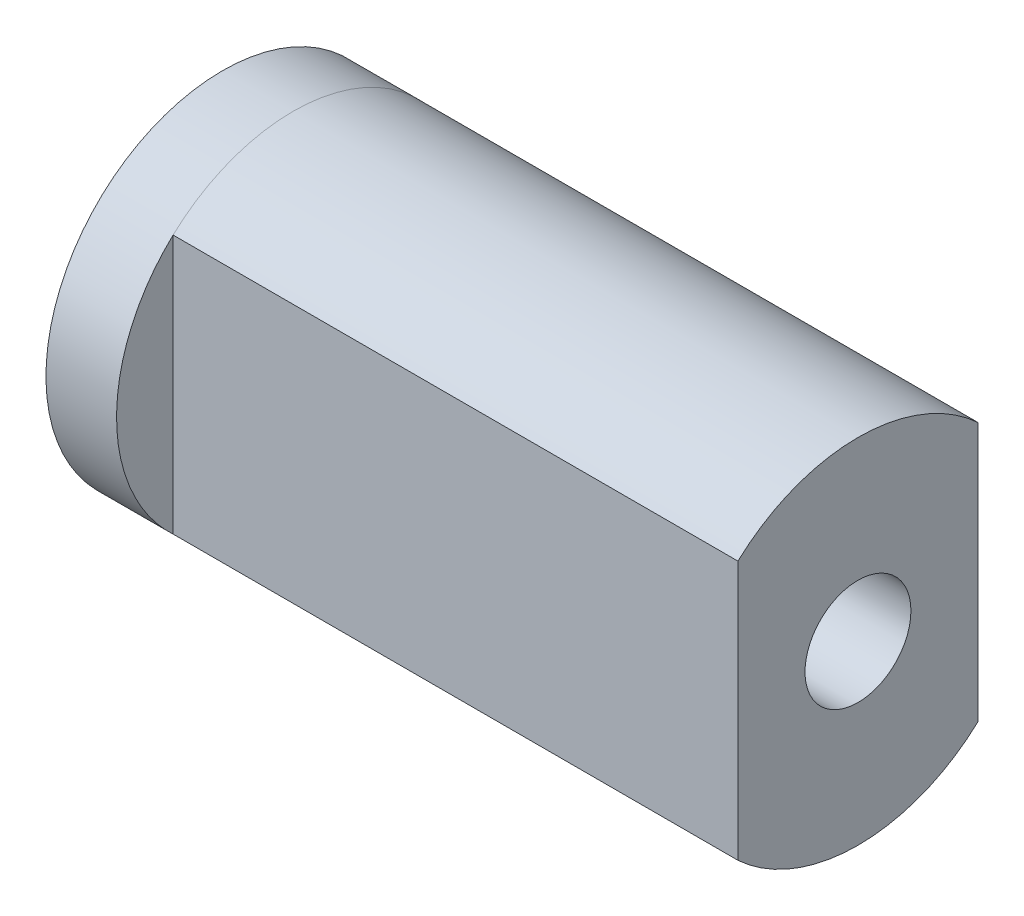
ISO-10303-21;
HEADER;
FILE_DESCRIPTION(('STEP AP214'),'2;1');
FILE_NAME('part.step','',(''),(''),'','','');
FILE_SCHEMA(('AUTOMOTIVE_DESIGN { 1 0 10303 214 1 1 1 1 }'));
ENDSEC;
DATA;
#1=APPLICATION_CONTEXT('core data for automotive mechanical design processes');
#2=APPLICATION_PROTOCOL_DEFINITION('international standard','automotive_design',2000,#1);
#3=PRODUCT_CONTEXT('',#1,'mechanical');
#4=PRODUCT('Part','Part','',(#3));
#5=PRODUCT_RELATED_PRODUCT_CATEGORY('part','',(#4));
#6=PRODUCT_DEFINITION_FORMATION('','',#4);
#7=PRODUCT_DEFINITION_CONTEXT('part definition',#1,'design');
#8=PRODUCT_DEFINITION('design','',#6,#7);
#9=PRODUCT_DEFINITION_SHAPE('','',#8);
#10=(LENGTH_UNIT() NAMED_UNIT(*) SI_UNIT(.MILLI.,.METRE.));
#11=(NAMED_UNIT(*) PLANE_ANGLE_UNIT() SI_UNIT($,.RADIAN.));
#12=(NAMED_UNIT(*) SI_UNIT($,.STERADIAN.) SOLID_ANGLE_UNIT());
#13=UNCERTAINTY_MEASURE_WITH_UNIT(LENGTH_MEASURE(1.E-05),#10,'distance_accuracy_value','');
#14=(GEOMETRIC_REPRESENTATION_CONTEXT(3) GLOBAL_UNCERTAINTY_ASSIGNED_CONTEXT((#13)) GLOBAL_UNIT_ASSIGNED_CONTEXT((#10,
#11,#12)) REPRESENTATION_CONTEXT('',''));
#15=CARTESIAN_POINT('',(0.,0.,0.));
#16=DIRECTION('',(0.,0.,1.));
#17=DIRECTION('',(1.,0.,0.));
#18=AXIS2_PLACEMENT_3D('',#15,#16,#17);
#19=CARTESIAN_POINT('',(1.,0.,0.));
#20=DIRECTION('',(1.,0.,0.));
#21=DIRECTION('',(0.,0.,-1.));
#22=AXIS2_PLACEMENT_3D('',#19,#20,#21);
#23=PLANE('',#22);
#24=DIRECTION('',(0.,-1.,0.));
#25=VECTOR('',#24,1.);
#26=CARTESIAN_POINT('',(1.,1.835,1.7));
#27=LINE('',#26,#25);
#28=CARTESIAN_POINT('',(1.,1.833936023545,1.69964922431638));
#29=VERTEX_POINT('',#28);
#30=CARTESIAN_POINT('',(1.,-1.83395021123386,1.69964698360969));
#31=VERTEX_POINT('',#30);
#32=EDGE_CURVE('E98',#29,#31,#27,.T.);
#33=ORIENTED_EDGE('',*,*,#32,.F.);
#34=CARTESIAN_POINT('',(1.,1.83352277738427,1.69952071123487));
#35=CARTESIAN_POINT('',(1.,1.81201965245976,1.72266553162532));
#36=CARTESIAN_POINT('',(1.,1.79009831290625,1.74542135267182));
#37=CARTESIAN_POINT('',(1.,1.74929792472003,1.78624775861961));
#38=CARTESIAN_POINT('',(1.,1.73054844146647,1.80444797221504));
#39=CARTESIAN_POINT('',(1.,1.69064109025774,1.84201087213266));
#40=CARTESIAN_POINT('',(1.,1.66942675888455,1.86131366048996));
#41=CARTESIAN_POINT('',(1.,1.62644035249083,1.89909971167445));
#42=CARTESIAN_POINT('',(1.,1.60467103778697,1.91758611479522));
#43=CARTESIAN_POINT('',(1.,1.56057551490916,1.95374038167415));
#44=CARTESIAN_POINT('',(1.,1.53825124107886,1.97141060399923));
#45=CARTESIAN_POINT('',(1.,1.49304663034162,2.00593324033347));
#46=CARTESIAN_POINT('',(1.,1.47016743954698,2.02278715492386));
#47=CARTESIAN_POINT('',(1.,1.42385378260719,2.05567807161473));
#48=CARTESIAN_POINT('',(1.,1.40041972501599,2.07171564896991));
#49=CARTESIAN_POINT('',(1.,1.3529970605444,2.10297482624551));
#50=CARTESIAN_POINT('',(1.,1.32900818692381,2.11819602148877));
#51=CARTESIAN_POINT('',(1.,1.28047657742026,2.14782342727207));
#52=CARTESIAN_POINT('',(1.,1.25593297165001,2.16222821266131));
#53=CARTESIAN_POINT('',(1.,1.20629240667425,2.19022382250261));
#54=CARTESIAN_POINT('',(1.,1.18119405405,2.20381217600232));
#55=CARTESIAN_POINT('',(1.,1.13044480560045,2.23017597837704));
#56=CARTESIAN_POINT('',(1.,1.10479207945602,2.24294790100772));
#57=CARTESIAN_POINT('',(1.,1.05293336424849,2.26767985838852));
#58=CARTESIAN_POINT('',(1.,1.02672518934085,2.27963531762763));
#59=CARTESIAN_POINT('',(1.,0.985843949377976,2.2974652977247));
#60=CARTESIAN_POINT('',(1.,0.971304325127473,2.30364862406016));
#61=CARTESIAN_POINT('',(1.,0.918052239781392,2.32572260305));
#62=CARTESIAN_POINT('',(1.,0.879002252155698,2.34081262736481));
#63=CARTESIAN_POINT('',(1.,0.8126715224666,2.36456467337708));
#64=CARTESIAN_POINT('',(1.,0.785576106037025,2.37374990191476));
#65=CARTESIAN_POINT('',(1.,0.731183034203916,2.39115111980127));
#66=CARTESIAN_POINT('',(1.,0.703886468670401,2.39937050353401));
#67=CARTESIAN_POINT('',(1.,0.649092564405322,2.41484028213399));
#68=CARTESIAN_POINT('',(1.,0.621595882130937,2.42209300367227));
#69=CARTESIAN_POINT('',(1.,0.56640190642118,2.43563075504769));
#70=CARTESIAN_POINT('',(1.,0.538704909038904,2.44191699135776));
#71=CARTESIAN_POINT('',(1.,0.483110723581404,2.45352284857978));
#72=CARTESIAN_POINT('',(1.,0.455213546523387,2.45884252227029));
#73=CARTESIAN_POINT('',(1.,0.399219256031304,2.46851643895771));
#74=CARTESIAN_POINT('',(1.,0.371121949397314,2.47286956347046));
#75=CARTESIAN_POINT('',(1.,0.314727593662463,2.48061152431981));
#76=CARTESIAN_POINT('',(1.,0.286430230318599,2.48399807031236));
#77=CARTESIAN_POINT('',(1.,0.229635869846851,2.48980814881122));
#78=CARTESIAN_POINT('',(1.,0.201138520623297,2.49222823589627));
#79=CARTESIAN_POINT('',(1.,0.143967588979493,2.49610456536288));
#80=CARTESIAN_POINT('',(1.,0.115293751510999,2.49755703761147));
#81=CARTESIAN_POINT('',(1.,0.0577467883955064,2.49950386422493));
#82=CARTESIAN_POINT('',(1.,0.0288734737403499,2.49999259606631));
#83=CARTESIAN_POINT('',(1.,-0.028840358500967,2.50000739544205));
#84=CARTESIAN_POINT('',(1.,-0.0576808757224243,2.49953456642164));
#85=CARTESIAN_POINT('',(1.,-0.115176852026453,2.49761145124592));
#86=CARTESIAN_POINT('',(1.,-0.143832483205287,2.49616634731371));
#87=CARTESIAN_POINT('',(1.,-0.200935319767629,2.49230279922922));
#88=CARTESIAN_POINT('',(1.,-0.229382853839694,2.48988922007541));
#89=CARTESIAN_POINT('',(1.,-0.286092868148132,2.4840894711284));
#90=CARTESIAN_POINT('',(1.,-0.314355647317,2.48070622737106));
#91=CARTESIAN_POINT('',(1.,-0.370696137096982,2.4729684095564));
#92=CARTESIAN_POINT('',(1.,-0.398774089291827,2.46861559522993));
#93=CARTESIAN_POINT('',(1.,-0.45474499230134,2.45893978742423));
#94=CARTESIAN_POINT('',(1.,-0.482638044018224,2.45361737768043));
#95=CARTESIAN_POINT('',(1.,-0.538239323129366,2.4420035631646));
#96=CARTESIAN_POINT('',(1.,-0.565947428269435,2.43571157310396));
#97=CARTESIAN_POINT('',(1.,-0.621178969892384,2.42215978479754));
#98=CARTESIAN_POINT('',(1.,-0.648701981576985,2.41489825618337));
#99=CARTESIAN_POINT('',(1.,-0.703563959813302,2.3994084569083));
#100=CARTESIAN_POINT('',(1.,-0.730902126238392,2.3911773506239));
#101=CARTESIAN_POINT('',(1.,-0.785393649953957,2.3737497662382));
#102=CARTESIAN_POINT('',(1.,-0.812545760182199,2.36454940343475));
#103=CARTESIAN_POINT('',(1.,-0.878954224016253,2.34078788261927));
#104=CARTESIAN_POINT('',(1.,-0.918027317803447,2.32570896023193));
#105=CARTESIAN_POINT('',(1.,-0.971352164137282,2.30363786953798));
#106=CARTESIAN_POINT('',(1.,-0.985939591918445,2.29744345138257));
#107=CARTESIAN_POINT('',(1.,-1.02680611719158,2.2796397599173));
#108=CARTESIAN_POINT('',(1.,-1.05295176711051,2.26772134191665));
#109=CARTESIAN_POINT('',(1.,-1.10469880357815,2.24305586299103));
#110=CARTESIAN_POINT('',(1.,-1.13030216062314,2.23031292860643));
#111=CARTESIAN_POINT('',(1.,-1.18096574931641,2.20399876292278));
#112=CARTESIAN_POINT('',(1.,-1.2060275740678,2.19043060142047));
#113=CARTESIAN_POINT('',(1.,-1.25560826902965,2.16246724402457));
#114=CARTESIAN_POINT('',(1.,-1.28012827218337,2.14807405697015));
#115=CARTESIAN_POINT('',(1.,-1.3286258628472,2.11846166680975));
#116=CARTESIAN_POINT('',(1.,-1.35260403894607,2.10324342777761));
#117=CARTESIAN_POINT('',(1.,-1.40001851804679,2.07198199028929));
#118=CARTESIAN_POINT('',(1.,-1.42345478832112,2.05593874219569));
#119=CARTESIAN_POINT('',(1.,-1.46978610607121,2.02302830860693));
#120=CARTESIAN_POINT('',(1.,-1.49268043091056,2.00616010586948));
#121=CARTESIAN_POINT('',(1.,-1.53792852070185,1.97160066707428));
#122=CARTESIAN_POINT('',(1.,-1.56028081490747,1.95390750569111));
#123=CARTESIAN_POINT('',(1.,-1.60444574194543,1.91769925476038));
#124=CARTESIAN_POINT('',(1.,-1.62625611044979,1.89918140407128));
#125=CARTESIAN_POINT('',(1.,-1.66933745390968,1.86132380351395));
#126=CARTESIAN_POINT('',(1.,-1.69060533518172,1.84198053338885));
#127=CARTESIAN_POINT('',(1.,-1.73055920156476,1.80439964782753));
#128=CARTESIAN_POINT('',(1.,-1.74930302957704,1.78622344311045));
#129=CARTESIAN_POINT('',(1.,-1.79011471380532,1.74542818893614));
#130=CARTESIAN_POINT('',(1.,-1.8120524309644,1.72267882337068));
#131=CARTESIAN_POINT('',(1.,-1.83356698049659,1.6995348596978));
#132=B_SPLINE_CURVE_WITH_KNOTS('',3,(#34,#35,#36,#37,#38,#39,#40,#41,#42,#43,#44,#45,#46,#47,
#48,#49,#50,#51,#52,#53,#54,#55,#56,#57,#58,#59,#60,#61,#62,#63,#64,#65,#66,#67,#68,#69,#70,#71,
#72,#73,#74,#75,#76,#77,#78,#79,#80,#81,#82,#83,#84,#85,#86,#87,#88,#89,#90,#91,#92,#93,#94,#95,
#96,#97,#98,#99,#100,#101,#102,#103,#104,#105,#106,#107,#108,#109,#110,#111,#112,#113,#114,#115,
#116,#117,#118,#119,#120,#121,#122,#123,#124,#125,#126,#127,#128,#129,#130,#131),.UNSPECIFIED.,
.F.,.F.,(4,2,2,2,2,2,2,2,2,2,2,2,2,2,2,2,2,2,2,2,2,2,2,2,2,2,2,2,2,2,2,2,2,2,2,2,2,2,2,2,2,2,2,
2,2,2,2,2,4),(0.,0.0947701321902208,0.173149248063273,0.259177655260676,0.344839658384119,
0.430236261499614,0.515469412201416,0.600641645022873,0.685855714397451,0.771214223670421,
0.856819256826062,0.942772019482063,1.02917249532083,1.0765706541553,1.20210309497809,
1.28791841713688,1.37342250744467,1.45871692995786,1.54390399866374,1.62908641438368,
1.71436689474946,1.79984780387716,1.88563078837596,1.97174608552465,2.05836231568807,
2.1448792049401,2.23093857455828,2.31657094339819,2.40194758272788,2.48717051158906,
2.57234230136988,2.65756570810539,2.74294330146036,2.82857709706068,2.91456819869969,
3.04015407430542,3.08769717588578,3.17388070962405,3.25966205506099,3.34514179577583,
3.43042158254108,3.5156037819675,3.60079111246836,3.68608627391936,3.77159157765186,
3.85740858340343,3.94363774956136,4.02195462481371,4.11674524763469),.UNSPECIFIED.);
#133=EDGE_CURVE('E44',#29,#31,#132,.T.);
#134=ORIENTED_EDGE('',*,*,#133,.T.);
#135=EDGE_LOOP('',(#33,#134));
#136=FACE_BOUND('',#135,.T.);
#137=ADVANCED_FACE('F33',(#136),#23,.T.);
#138=CARTESIAN_POINT('',(1.,0.,0.));
#139=DIRECTION('',(-1.,0.,0.));
#140=DIRECTION('',(0.,0.,1.));
#141=AXIS2_PLACEMENT_3D('',#138,#139,#140);
#142=CYLINDRICAL_SURFACE('',#141,2.5);
#143=CARTESIAN_POINT('',(1.,0.,0.));
#144=DIRECTION('',(1.,0.,0.));
#145=DIRECTION('',(0.,0.733576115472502,-0.679607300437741));
#146=AXIS2_PLACEMENT_3D('',#143,#144,#145);
#147=CIRCLE('',#146,2.5014445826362);
#148=CARTESIAN_POINT('',(1.,1.83395021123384,-1.6996469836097));
#149=VERTEX_POINT('',#148);
#150=EDGE_CURVE('E11',#149,#29,#147,.T.);
#151=ORIENTED_EDGE('',*,*,#150,.F.);
#152=CARTESIAN_POINT('',(1.,-1.83352266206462,-1.69952083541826));
#153=CARTESIAN_POINT('',(1.,-1.8120195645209,-1.72266616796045));
#154=CARTESIAN_POINT('',(1.,-1.79009812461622,-1.74542177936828));
#155=CARTESIAN_POINT('',(1.,-1.75444729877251,-1.7810949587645));
#156=CARTESIAN_POINT('',(1.,-1.74098187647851,-1.79427694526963));
#157=CARTESIAN_POINT('',(1.,-1.71381360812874,-1.82029177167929));
#158=CARTESIAN_POINT('',(1.,-1.70011182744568,-1.83312572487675));
#159=CARTESIAN_POINT('',(1.,-1.66094992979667,-1.86899698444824));
#160=CARTESIAN_POINT('',(1.,-1.6351577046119,-1.89167373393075));
#161=CARTESIAN_POINT('',(1.,-1.58277051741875,-1.9358462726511));
#162=CARTESIAN_POINT('',(1.,-1.55617946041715,-1.95734669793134));
#163=CARTESIAN_POINT('',(1.,-1.50219547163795,-1.99916901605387));
#164=CARTESIAN_POINT('',(1.,-1.4748047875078,-2.01949380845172));
#165=CARTESIAN_POINT('',(1.,-1.41922347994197,-2.05896641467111));
#166=CARTESIAN_POINT('',(1.,-1.3910335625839,-2.07811522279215));
#167=CARTESIAN_POINT('',(1.,-1.33385510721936,-2.11523788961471));
#168=CARTESIAN_POINT('',(1.,-1.30486588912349,-2.13321070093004));
#169=CARTESIAN_POINT('',(1.,-1.24609075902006,-2.1679833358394));
#170=CARTESIAN_POINT('',(1.,-1.21630296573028,-2.18477997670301));
#171=CARTESIAN_POINT('',(1.,-1.14902578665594,-2.22091048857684));
#172=CARTESIAN_POINT('',(1.,-1.11136229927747,-2.23992090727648));
#173=CARTESIAN_POINT('',(1.,-1.03483887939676,-2.27618479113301));
#174=CARTESIAN_POINT('',(1.,-0.995971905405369,-2.29342339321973));
#175=CARTESIAN_POINT('',(1.,-0.932007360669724,-2.31993798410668));
#176=CARTESIAN_POINT('',(1.,-0.907149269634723,-2.32979592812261));
#177=CARTESIAN_POINT('',(1.,-0.857261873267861,-2.34867542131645));
#178=CARTESIAN_POINT('',(1.,-0.832234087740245,-2.35770097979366));
#179=CARTESIAN_POINT('',(1.,-0.774644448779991,-2.37744132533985));
#180=CARTESIAN_POINT('',(1.,-0.741991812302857,-2.38789240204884));
#181=CARTESIAN_POINT('',(1.,-0.67640197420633,-2.40739491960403));
#182=CARTESIAN_POINT('',(1.,-0.643466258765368,-2.41645136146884));
#183=CARTESIAN_POINT('',(1.,-0.577310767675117,-2.43316714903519));
#184=CARTESIAN_POINT('',(1.,-0.544091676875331,-2.44082920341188));
#185=CARTESIAN_POINT('',(1.,-0.477370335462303,-2.45475846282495));
#186=CARTESIAN_POINT('',(1.,-0.443868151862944,-2.4610259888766));
#187=CARTESIAN_POINT('',(1.,-0.376581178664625,-2.4721686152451));
#188=CARTESIAN_POINT('',(1.,-0.342796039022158,-2.47704160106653));
#189=CARTESIAN_POINT('',(1.,-0.274943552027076,-2.48539763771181));
#190=CARTESIAN_POINT('',(1.,-0.240875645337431,-2.48887614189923));
#191=CARTESIAN_POINT('',(1.,-0.172481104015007,-2.49444354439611));
#192=CARTESIAN_POINT('',(1.,-0.138153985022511,-2.49652647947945));
#193=CARTESIAN_POINT('',(1.,-0.069218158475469,-2.49930961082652));
#194=CARTESIAN_POINT('',(1.,-0.0346090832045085,-2.50000062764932));
#195=CARTESIAN_POINT('',(1.,0.0346071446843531,-2.49999937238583));
#196=CARTESIAN_POINT('',(1.,0.0692142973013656,-2.49930717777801));
#197=CARTESIAN_POINT('',(1.,0.138156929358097,-2.49651714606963));
#198=CARTESIAN_POINT('',(1.,0.172492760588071,-2.49442807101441));
#199=CARTESIAN_POINT('',(1.,0.240869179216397,-2.48884912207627));
#200=CARTESIAN_POINT('',(1.,0.274910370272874,-2.48536665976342));
#201=CARTESIAN_POINT('',(1.,0.342720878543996,-2.47700310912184));
#202=CARTESIAN_POINT('',(1.,0.376490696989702,-2.47212608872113));
#203=CARTESIAN_POINT('',(1.,0.443758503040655,-2.46097588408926));
#204=CARTESIAN_POINT('',(1.,0.477256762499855,-2.4547043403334));
#205=CARTESIAN_POINT('',(1.,0.543981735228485,-2.44076756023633));
#206=CARTESIAN_POINT('',(1.,0.577208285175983,-2.43310154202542));
#207=CARTESIAN_POINT('',(1.,0.643390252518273,-2.41637810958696));
#208=CARTESIAN_POINT('',(1.,0.676344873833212,-2.40731754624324));
#209=CARTESIAN_POINT('',(1.,0.741983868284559,-2.38780787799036));
#210=CARTESIAN_POINT('',(1.,0.774666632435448,-2.37735336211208));
#211=CARTESIAN_POINT('',(1.,0.839761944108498,-2.35505613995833));
#212=CARTESIAN_POINT('',(1.,0.872171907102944,-2.34320589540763));
#213=CARTESIAN_POINT('',(1.,0.936639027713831,-2.31816003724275));
#214=CARTESIAN_POINT('',(1.,0.96869387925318,-2.30495849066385));
#215=CARTESIAN_POINT('',(1.,1.03205823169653,-2.27734979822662));
#216=CARTESIAN_POINT('',(1.,1.06337098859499,-2.26295013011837));
#217=CARTESIAN_POINT('',(1.,1.12521263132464,-2.23295426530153));
#218=CARTESIAN_POINT('',(1.,1.15574480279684,-2.21736484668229));
#219=CARTESIAN_POINT('',(1.,1.21602655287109,-2.18499318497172));
#220=CARTESIAN_POINT('',(1.,1.24577858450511,-2.16821551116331));
#221=CARTESIAN_POINT('',(1.,1.30450076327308,-2.13346916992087));
#222=CARTESIAN_POINT('',(1.,1.33347232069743,-2.1155028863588));
#223=CARTESIAN_POINT('',(1.,1.39063469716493,-2.07838164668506));
#224=CARTESIAN_POINT('',(1.,1.41882568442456,-2.0592269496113));
#225=CARTESIAN_POINT('',(1.,1.47442813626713,-2.01973091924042));
#226=CARTESIAN_POINT('',(1.,1.50183835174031,-1.99938782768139));
#227=CARTESIAN_POINT('',(1.,1.55588091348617,-1.95751722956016));
#228=CARTESIAN_POINT('',(1.,1.58251044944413,-1.93598609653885));
#229=CARTESIAN_POINT('',(1.,1.6349924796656,-1.89174044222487));
#230=CARTESIAN_POINT('',(1.,1.66084049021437,-1.86902060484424));
#231=CARTESIAN_POINT('',(1.,1.71176399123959,-1.82240221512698));
#232=CARTESIAN_POINT('',(1.,1.73683327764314,-1.79849688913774));
#233=CARTESIAN_POINT('',(1.,1.78595816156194,-1.74972802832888));
#234=CARTESIAN_POINT('',(1.,1.81001501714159,-1.72486576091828));
#235=CARTESIAN_POINT('',(1.,1.83356698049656,-1.69953485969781));
#236=B_SPLINE_CURVE_WITH_KNOTS('',3,(#152,#153,#154,#155,#156,#157,#158,#159,#160,#161,#162,
#163,#164,#165,#166,#167,#168,#169,#170,#171,#172,#173,#174,#175,#176,#177,#178,#179,#180,#181,
#182,#183,#184,#185,#186,#187,#188,#189,#190,#191,#192,#193,#194,#195,#196,#197,#198,#199,#200,
#201,#202,#203,#204,#205,#206,#207,#208,#209,#210,#211,#212,#213,#214,#215,#216,#217,#218,#219,
#220,#221,#222,#223,#224,#225,#226,#227,#228,#229,#230,#231,#232,#233,#234,#235),.UNSPECIFIED.,
.F.,.F.,(4,2,2,2,2,2,2,2,2,2,2,2,2,2,2,2,2,2,2,2,2,2,2,2,2,2,2,2,2,2,2,2,2,2,2,2,2,2,2,2,2,4),
(0.,0.0947699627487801,0.151296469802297,0.207613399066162,0.310612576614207,0.413171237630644,
0.515465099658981,0.617671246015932,0.719967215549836,0.822530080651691,0.949043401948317,
1.07654366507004,1.15675623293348,1.23655970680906,1.33938274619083,1.44182802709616,
1.54407212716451,1.64629266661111,1.74866738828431,1.85137323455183,1.95451518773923,
2.05833514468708,2.16214928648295,2.26531827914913,2.36794564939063,2.47027665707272,
2.57248791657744,2.67475666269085,2.77725983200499,2.88017315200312,2.98367026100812,
3.08764303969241,3.191009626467,3.2938259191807,3.39626631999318,3.49850715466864,
3.60072578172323,3.70309967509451,3.80580550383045,3.90901823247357,4.01291026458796,
4.11666913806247),.UNSPECIFIED.);
#237=CARTESIAN_POINT('',(1.,-1.83393587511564,-1.69964929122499));
#238=VERTEX_POINT('',#237);
#239=EDGE_CURVE('E105',#238,#149,#236,.T.);
#240=ORIENTED_EDGE('',*,*,#239,.F.);
#241=CARTESIAN_POINT('',(1.,0.,0.));
#242=DIRECTION('',(1.,0.,0.));
#243=DIRECTION('',(0.,-0.733576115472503,0.67960730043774));
#244=AXIS2_PLACEMENT_3D('',#241,#242,#243);
#245=CIRCLE('',#244,2.5014445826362);
#246=EDGE_CURVE('E56',#31,#238,#245,.T.);
#247=ORIENTED_EDGE('',*,*,#246,.F.);
#248=ORIENTED_EDGE('',*,*,#133,.F.);
#249=EDGE_LOOP('',(#151,#240,#247,#248));
#250=FACE_BOUND('',#249,.T.);
#251=CARTESIAN_POINT('',(0.,0.,0.));
#252=DIRECTION('',(1.,0.,0.));
#253=DIRECTION('',(0.,0.,-1.));
#254=AXIS2_PLACEMENT_3D('',#251,#252,#253);
#255=CIRCLE('',#254,2.5);
#256=CARTESIAN_POINT('',(0.,0.,-2.5));
#257=VERTEX_POINT('',#256);
#258=EDGE_CURVE('E102',#257,#257,#255,.T.);
#259=ORIENTED_EDGE('',*,*,#258,.T.);
#260=EDGE_LOOP('',(#259));
#261=FACE_BOUND('',#260,.T.);
#262=ADVANCED_FACE('F35',(#250,#261),#142,.T.);
#263=DIRECTION('',(0.,1.,0.));
#264=VECTOR('',#263,1.);
#265=CARTESIAN_POINT('',(1.,1.835,-1.7));
#266=LINE('',#265,#264);
#267=EDGE_CURVE('E50',#238,#149,#266,.T.);
#268=ORIENTED_EDGE('',*,*,#267,.F.);
#269=ORIENTED_EDGE('',*,*,#239,.T.);
#270=EDGE_LOOP('',(#268,#269));
#271=FACE_BOUND('',#270,.T.);
#272=ADVANCED_FACE('F141',(#271),#23,.T.);
#273=CARTESIAN_POINT('',(0.,0.,0.));
#274=DIRECTION('',(1.,0.,0.));
#275=DIRECTION('',(0.,0.,-1.));
#276=AXIS2_PLACEMENT_3D('',#273,#274,#275);
#277=PLANE('',#276);
#278=ORIENTED_EDGE('',*,*,#258,.F.);
#279=EDGE_LOOP('',(#278));
#280=FACE_BOUND('',#279,.T.);
#281=ADVANCED_FACE('F140',(#280),#277,.F.);
#282=CARTESIAN_POINT('',(9.,0.,0.));
#283=DIRECTION('',(-1.,0.,0.));
#284=DIRECTION('',(0.,0.,1.));
#285=AXIS2_PLACEMENT_3D('',#282,#283,#284);
#286=CYLINDRICAL_SURFACE('',#285,2.5014445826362);
#287=ORIENTED_EDGE('',*,*,#246,.T.);
#288=DIRECTION('',(-1.,0.,0.));
#289=VECTOR('',#288,1.);
#290=CARTESIAN_POINT('',(9.,-1.835,-1.7));
#291=LINE('',#290,#289);
#292=CARTESIAN_POINT('',(9.,-1.835,-1.7));
#293=VERTEX_POINT('',#292);
#294=EDGE_CURVE('E83',#293,#238,#291,.T.);
#295=ORIENTED_EDGE('',*,*,#294,.F.);
#296=CARTESIAN_POINT('',(9.,0.,0.));
#297=DIRECTION('',(1.,0.,0.));
#298=DIRECTION('',(0.,0.,-1.));
#299=AXIS2_PLACEMENT_3D('',#296,#297,#298);
#300=CIRCLE('',#299,2.5014445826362);
#301=CARTESIAN_POINT('',(9.,-1.835,1.7));
#302=VERTEX_POINT('',#301);
#303=EDGE_CURVE('E89',#302,#293,#300,.T.);
#304=ORIENTED_EDGE('',*,*,#303,.F.);
#305=DIRECTION('',(-1.,0.,0.));
#306=VECTOR('',#305,1.);
#307=CARTESIAN_POINT('',(9.,-1.835,1.7));
#308=LINE('',#307,#306);
#309=EDGE_CURVE('E157',#302,#31,#308,.T.);
#310=ORIENTED_EDGE('',*,*,#309,.T.);
#311=EDGE_LOOP('',(#287,#295,#304,#310));
#312=FACE_BOUND('',#311,.T.);
#313=ADVANCED_FACE('F100',(#312),#286,.T.);
#314=CARTESIAN_POINT('',(9.,1.835,-1.7));
#315=DIRECTION('',(0.,0.,1.));
#316=DIRECTION('',(0.,-1.,0.));
#317=AXIS2_PLACEMENT_3D('',#314,#315,#316);
#318=PLANE('',#317);
#319=ORIENTED_EDGE('',*,*,#267,.T.);
#320=DIRECTION('',(-1.,0.,0.));
#321=VECTOR('',#320,1.);
#322=CARTESIAN_POINT('',(9.,1.835,-1.7));
#323=LINE('',#322,#321);
#324=CARTESIAN_POINT('',(9.,1.835,-1.7));
#325=VERTEX_POINT('',#324);
#326=EDGE_CURVE('E85',#325,#149,#323,.T.);
#327=ORIENTED_EDGE('',*,*,#326,.F.);
#328=DIRECTION('',(0.,1.,0.));
#329=VECTOR('',#328,1.);
#330=CARTESIAN_POINT('',(9.,1.835,-1.7));
#331=LINE('',#330,#329);
#332=EDGE_CURVE('E79',#293,#325,#331,.T.);
#333=ORIENTED_EDGE('',*,*,#332,.F.);
#334=ORIENTED_EDGE('',*,*,#294,.T.);
#335=EDGE_LOOP('',(#319,#327,#333,#334));
#336=FACE_BOUND('',#335,.T.);
#337=ADVANCED_FACE('F81',(#336),#318,.F.);
#338=CARTESIAN_POINT('',(9.,0.,0.));
#339=DIRECTION('',(-1.,0.,0.));
#340=DIRECTION('',(0.,0.,1.));
#341=AXIS2_PLACEMENT_3D('',#338,#339,#340);
#342=CYLINDRICAL_SURFACE('',#341,2.5014445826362);
#343=ORIENTED_EDGE('',*,*,#150,.T.);
#344=DIRECTION('',(-1.,0.,0.));
#345=VECTOR('',#344,1.);
#346=CARTESIAN_POINT('',(9.,1.835,1.7));
#347=LINE('',#346,#345);
#348=CARTESIAN_POINT('',(9.,1.835,1.7));
#349=VERTEX_POINT('',#348);
#350=EDGE_CURVE('E107',#349,#29,#347,.T.);
#351=ORIENTED_EDGE('',*,*,#350,.F.);
#352=CARTESIAN_POINT('',(9.,0.,0.));
#353=DIRECTION('',(1.,0.,0.));
#354=DIRECTION('',(0.,0.,-1.));
#355=AXIS2_PLACEMENT_3D('',#352,#353,#354);
#356=CIRCLE('',#355,2.5014445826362);
#357=EDGE_CURVE('E88',#325,#349,#356,.T.);
#358=ORIENTED_EDGE('',*,*,#357,.F.);
#359=ORIENTED_EDGE('',*,*,#326,.T.);
#360=EDGE_LOOP('',(#343,#351,#358,#359));
#361=FACE_BOUND('',#360,.T.);
#362=ADVANCED_FACE('F123',(#361),#342,.T.);
#363=CARTESIAN_POINT('',(9.,1.835,1.7));
#364=DIRECTION('',(0.,0.,-1.));
#365=DIRECTION('',(0.,1.,0.));
#366=AXIS2_PLACEMENT_3D('',#363,#364,#365);
#367=PLANE('',#366);
#368=ORIENTED_EDGE('',*,*,#32,.T.);
#369=ORIENTED_EDGE('',*,*,#309,.F.);
#370=DIRECTION('',(0.,-1.,0.));
#371=VECTOR('',#370,1.);
#372=CARTESIAN_POINT('',(9.,1.835,1.7));
#373=LINE('',#372,#371);
#374=EDGE_CURVE('E94',#349,#302,#373,.T.);
#375=ORIENTED_EDGE('',*,*,#374,.F.);
#376=ORIENTED_EDGE('',*,*,#350,.T.);
#377=EDGE_LOOP('',(#368,#369,#375,#376));
#378=FACE_BOUND('',#377,.T.);
#379=ADVANCED_FACE('F133',(#378),#367,.F.);
#380=CARTESIAN_POINT('',(9.,0.,0.));
#381=DIRECTION('',(1.,0.,0.));
#382=DIRECTION('',(0.,0.,-1.));
#383=AXIS2_PLACEMENT_3D('',#380,#381,#382);
#384=PLANE('',#383);
#385=CARTESIAN_POINT('',(9.,0.,0.));
#386=DIRECTION('',(1.,0.,0.));
#387=DIRECTION('',(0.,0.,-1.));
#388=AXIS2_PLACEMENT_3D('',#385,#386,#387);
#389=CIRCLE('',#388,0.75);
#390=CARTESIAN_POINT('',(9.,0.,-0.75));
#391=VERTEX_POINT('',#390);
#392=EDGE_CURVE('E162',#391,#391,#389,.T.);
#393=ORIENTED_EDGE('',*,*,#392,.F.);
#394=EDGE_LOOP('',(#393));
#395=FACE_BOUND('',#394,.T.);
#396=ORIENTED_EDGE('',*,*,#303,.T.);
#397=ORIENTED_EDGE('',*,*,#332,.T.);
#398=ORIENTED_EDGE('',*,*,#357,.T.);
#399=ORIENTED_EDGE('',*,*,#374,.T.);
#400=EDGE_LOOP('',(#396,#397,#398,#399));
#401=FACE_BOUND('',#400,.T.);
#402=ADVANCED_FACE('F92',(#395,#401),#384,.T.);
#403=CARTESIAN_POINT('',(4.,0.,0.));
#404=DIRECTION('',(1.,0.,0.));
#405=DIRECTION('',(0.,0.,-1.));
#406=AXIS2_PLACEMENT_3D('',#403,#404,#405);
#407=CYLINDRICAL_SURFACE('',#406,0.75);
#408=CARTESIAN_POINT('',(4.,0.,0.));
#409=DIRECTION('',(1.,0.,0.));
#410=DIRECTION('',(0.,0.,-1.));
#411=AXIS2_PLACEMENT_3D('',#408,#409,#410);
#412=CIRCLE('',#411,0.75);
#413=CARTESIAN_POINT('',(4.,0.,-0.75));
#414=VERTEX_POINT('',#413);
#415=EDGE_CURVE('E160',#414,#414,#412,.T.);
#416=ORIENTED_EDGE('',*,*,#415,.F.);
#417=EDGE_LOOP('',(#416));
#418=FACE_BOUND('',#417,.T.);
#419=ORIENTED_EDGE('',*,*,#392,.T.);
#420=EDGE_LOOP('',(#419));
#421=FACE_BOUND('',#420,.T.);
#422=ADVANCED_FACE('F249',(#418,#421),#407,.F.);
#423=CARTESIAN_POINT('',(4.,0.,0.));
#424=DIRECTION('',(1.,0.,0.));
#425=DIRECTION('',(0.,0.,-1.));
#426=AXIS2_PLACEMENT_3D('',#423,#424,#425);
#427=PLANE('',#426);
#428=ORIENTED_EDGE('',*,*,#415,.T.);
#429=EDGE_LOOP('',(#428));
#430=FACE_BOUND('',#429,.T.);
#431=ADVANCED_FACE('F258',(#430),#427,.T.);
#432=CLOSED_SHELL('',(#137,#262,#272,#281,#313,#337,#362,#379,#402,#422,#431));
#433=MANIFOLD_SOLID_BREP('B2',#432);
#434=ADVANCED_BREP_SHAPE_REPRESENTATION('',(#18,#433),#14);
#435=SHAPE_DEFINITION_REPRESENTATION(#9,#434);
ENDSEC;
END-ISO-10303-21;
